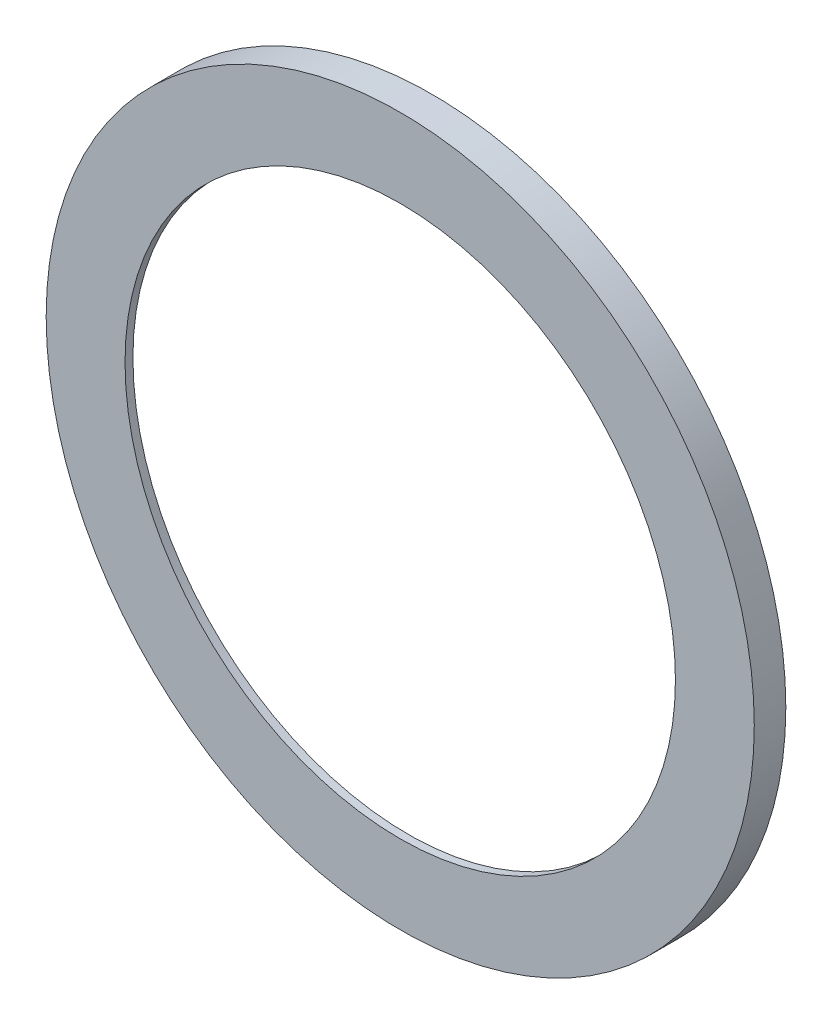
from build123d import *

# Parameters (mm, degrees)
SKETCH1_R          = 224.5
SKETCH1_R_2        = 174.5
EXTRUDE1_DEPTH     = 20
SKETCH2_R          = 222
SKETCH2_R_2        = 174.5
CUT_EXTRUDE1_DEPTH = 15


with BuildPart() as part:
    # Sketch1 → Extrude1 (new body)
    with BuildSketch(Plane.XY):
        Circle(SKETCH1_R)
        Circle(SKETCH1_R_2, mode=Mode.SUBTRACT)
    extrude(amount=EXTRUDE1_DEPTH)

    # Sketch2 → Cut-Extrude1 (cut)
    with BuildSketch(Plane(origin=(0, 0, 0), x_dir=(-1, 0, 0), z_dir=(0, 0, -1))):
        Circle(SKETCH2_R)
        Circle(SKETCH2_R_2, mode=Mode.SUBTRACT)
    extrude(amount=-CUT_EXTRUDE1_DEPTH, mode=Mode.SUBTRACT)


solid = part.part
